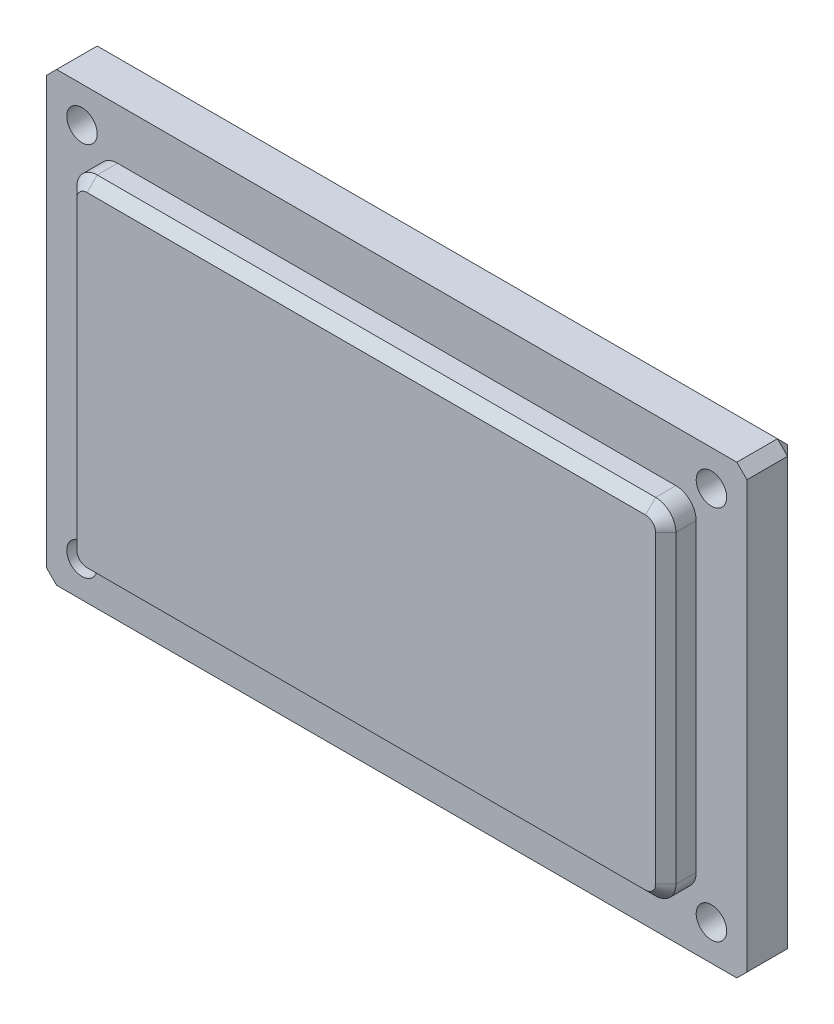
from build123d import *

# Parameters (mm, degrees)
SKICA1_W                 = 69
SKICA1_H                 = 44
P_IDAT_VYSUNUT_M1_DEPTH  = 8
SKICA2_W                 = 69
SKICA2_H                 = 44
SKICA2_W_2               = 59
SKICA2_H_2               = 34
ODEBRAT_VYSUNUT_M1_DEPTH = 3
SKICA3_R                 = 1.5
ODEBRAT_VYSUNUT_M2_DEPTH = 5
ZAOBLIT1_R               = 2
ZKOSEN_2_SIZE            = 1


with BuildPart() as part:
    # Skica1 → P_idat vysunut_m1 (new body)
    with BuildSketch(Plane.XY):
        Rectangle(SKICA1_W, SKICA1_H)
    extrude(amount=P_IDAT_VYSUNUT_M1_DEPTH)

    # Skica2 → Odebrat vysunut_m1 (cut)
    with BuildSketch(Plane.XY.offset(8)):
        Rectangle(SKICA2_W, SKICA2_H)
        Rectangle(SKICA2_W_2, SKICA2_H_2, mode=Mode.SUBTRACT)
    extrude(amount=-ODEBRAT_VYSUNUT_M1_DEPTH, mode=Mode.SUBTRACT)

    # Skica3 → Odebrat vysunut_m2 (cut)
    with BuildSketch(Plane.XY.offset(5)):
        with Locations((-31, 18.5)):
            Circle(SKICA3_R)
        with Locations(Location((-31, -18.5, 0), (0, 0, 180))):
            Circle(SKICA3_R)
        with Locations(Location((31, 18.5, 0), (0, 0, 180))):
            Circle(SKICA3_R)
        with Locations((31, -18.5)):
            Circle(SKICA3_R)
    extrude(amount=-ODEBRAT_VYSUNUT_M2_DEPTH, mode=Mode.SUBTRACT)

    # Zaoblit1
    zaoblit1_edges = [part.edges().sort_by_distance(p)[0] for p in [
        (-29.5, 17, 6.5),
        (29.5, 17, 6.5),
        (29.5, -17, 6.5),
        (-29.5, -17, 6.5),
    ]]
    fillet(zaoblit1_edges, radius=ZAOBLIT1_R)

    # Zkosen_2
    zkosen_2_edges = [part.edges().sort_by_distance(p)[0] for p in [
        (34.5, -22, 2.5),
        (-34.5, -22, 2.5),
        (-34.5, 22, 2.5),
        (34.5, 22, 2.5),
        (0, -22, 0),
        (-34.5, 0, 0),
        (0, -17, 8),
        (0, 22, 0),
        (0, 17, 8),
        (-29.5, 0, 8),
        (29.5, 0, 8),
        (28.914213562, 16.414213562, 8),
        (-28.914213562, 16.414213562, 8),
        (34.5, 0, 0),
        (-28.914213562, -16.414213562, 8),
        (28.914213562, -16.414213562, 8),
    ]]
    chamfer(zkosen_2_edges, length=ZKOSEN_2_SIZE)


solid = part.part
